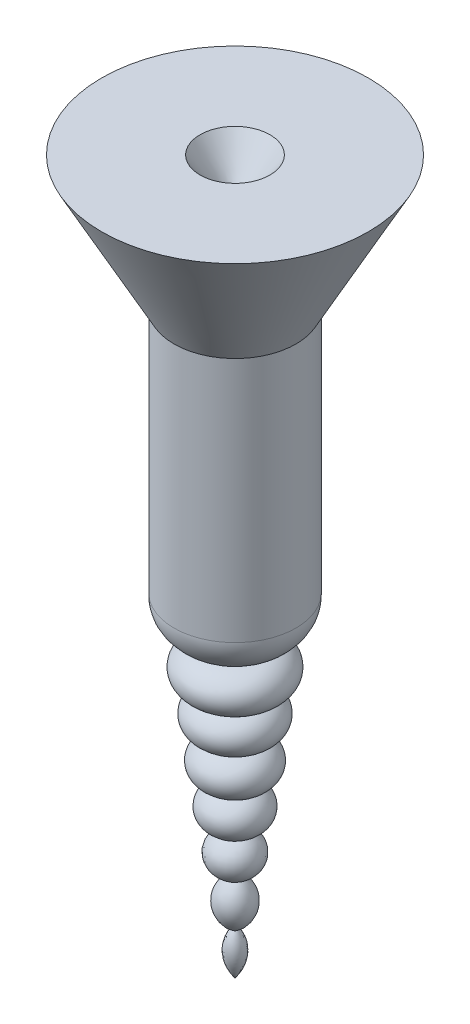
from build123d import *


with BuildPart() as part:
    # Sketch1 → Revolve3 (revolve)
    with BuildSketch(Plane.XY, mode=Mode.PRIVATE) as revolve3_sk:
        with BuildLine():
            Line((0.623803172, 0.875180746), (0, 0))
            Line((0, 0), (0, -11.857464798))
            add(Edge.make_bspline(
                [(0, -11.857464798), (0.30270275, -11.460250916), (0.057170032, -11.087499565)],
                knots=[5.854195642, 5.854195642, 5.854195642, 6.550159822, 6.550159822, 6.550159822], degree=2, weights=[1, 0.940062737, 1]))
            add(Edge.make_bspline(
                [(0.057170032, -11.087499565), (0.629450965, -10.702972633), (0.112621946, -10.271101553)],
                knots=[2.269397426, 2.269397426, 2.269397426, 3.905218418, 3.905218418, 3.905218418], degree=2, weights=[1, 0.683747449, 1]))
            add(Edge.make_bspline(
                [(0.112621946, -10.271101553), (1.053395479, -9.963688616), (0.167648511, -9.5651572)],
                knots=[5.100165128, 5.100165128, 5.100165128, 7.341650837, 7.341650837, 7.341650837], degree=2, weights=[1, 0.435013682, 1]))
            add(Edge.make_bspline(
                [(0.167648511, -9.5651572), (1.533449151, -9.312381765), (0.253793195, -8.854401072)],
                knots=[1.798140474, 1.798140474, 1.798140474, 4.291726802, 4.291726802, 4.291726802], degree=2, weights=[1, 0.318363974, 1]))
            add(Edge.make_bspline(
                [(0.253793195, -8.854401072), (0.628515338, -8.804544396), (0.638735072, -8.500759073), (0.648954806, -8.19697375), (0.278127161, -8.131065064)],
                knots=[1.735600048, 1.735600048, 1.735600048, 3.114686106, 3.114686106, 4.493772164, 4.493772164, 4.493772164], degree=2, weights=[1, 0.771536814, 1, 0.771536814, 1]))
            add(Edge.make_bspline(
                [(0.278127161, -8.131065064), (0.661274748, -8.123047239), (0.717970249, -7.819797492), (0.77466575, -7.516547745), (0.41121792, -7.419196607)],
                knots=[4.738540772, 4.738540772, 4.738540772, 6.134718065, 6.134718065, 7.530895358, 7.530895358, 7.530895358], degree=2, weights=[1, 0.766072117, 1, 0.766072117, 1]))
            add(Edge.make_bspline(
                [(0.41121792, -7.419196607), (0.896113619, -7.400622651), (0.857038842, -7.013521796), (0.817964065, -6.626420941), (0.335626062, -6.670333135)],
                knots=[4.760233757, 4.760233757, 4.760233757, 6.363764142, 6.363764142, 7.967294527, 7.967294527, 7.967294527], degree=2, weights=[1, 0.695439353, 1, 0.695439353, 1]))
            add(Edge.make_bspline(
                [(0.335626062, -6.670333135), (1.119222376, -6.539817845), (1.089956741, -5.899926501)],
                knots=[4.917655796, 4.917655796, 4.917655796, 6.319757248, 6.319757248, 6.319757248], degree=2, weights=[1, 0.764164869, 1]))
            Line((1.089956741, -5.899926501), (1.089956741, -1.505686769))
            Line((1.089956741, -1.505686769), (2.38125, 0.875180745))
            Line((2.38125, 0.875180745), (0.623803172, 0.875180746))
        make_face()
    revolve(revolve3_sk.sketch.rotate(Axis((0, 0, 0), (0, -1, 0)), 90), axis=Axis((0, 0, 0), (0, -1, 0)))


solid = part.part
